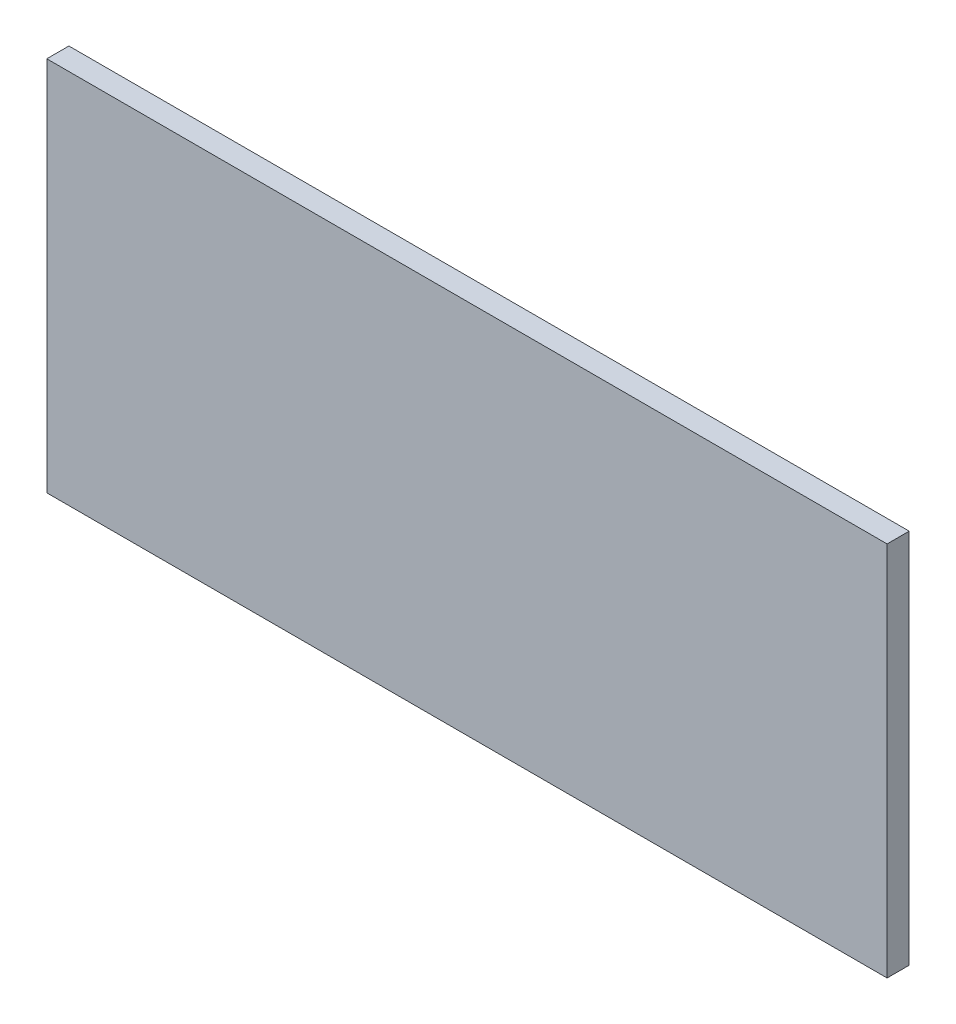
ISO-10303-21;
HEADER;
FILE_DESCRIPTION(('STEP AP214'),'2;1');
FILE_NAME('part.step','',(''),(''),'','','');
FILE_SCHEMA(('AUTOMOTIVE_DESIGN { 1 0 10303 214 1 1 1 1 }'));
ENDSEC;
DATA;
#1=APPLICATION_CONTEXT('core data for automotive mechanical design processes');
#2=APPLICATION_PROTOCOL_DEFINITION('international standard','automotive_design',2000,#1);
#3=PRODUCT_CONTEXT('',#1,'mechanical');
#4=PRODUCT('Part','Part','',(#3));
#5=PRODUCT_RELATED_PRODUCT_CATEGORY('part','',(#4));
#6=PRODUCT_DEFINITION_FORMATION('','',#4);
#7=PRODUCT_DEFINITION_CONTEXT('part definition',#1,'design');
#8=PRODUCT_DEFINITION('design','',#6,#7);
#9=PRODUCT_DEFINITION_SHAPE('','',#8);
#10=(LENGTH_UNIT() NAMED_UNIT(*) SI_UNIT(.MILLI.,.METRE.));
#11=(NAMED_UNIT(*) PLANE_ANGLE_UNIT() SI_UNIT($,.RADIAN.));
#12=(NAMED_UNIT(*) SI_UNIT($,.STERADIAN.) SOLID_ANGLE_UNIT());
#13=UNCERTAINTY_MEASURE_WITH_UNIT(LENGTH_MEASURE(1.E-05),#10,'distance_accuracy_value','');
#14=(GEOMETRIC_REPRESENTATION_CONTEXT(3) GLOBAL_UNCERTAINTY_ASSIGNED_CONTEXT((#13)) GLOBAL_UNIT_ASSIGNED_CONTEXT((#10,
#11,#12)) REPRESENTATION_CONTEXT('',''));
#15=CARTESIAN_POINT('',(0.,0.,0.));
#16=DIRECTION('',(0.,0.,1.));
#17=DIRECTION('',(1.,0.,0.));
#18=AXIS2_PLACEMENT_3D('',#15,#16,#17);
#19=CARTESIAN_POINT('',(-95.,-42.5,5.));
#20=DIRECTION('',(1.,0.,0.));
#21=DIRECTION('',(0.,0.,-1.));
#22=AXIS2_PLACEMENT_3D('',#19,#20,#21);
#23=PLANE('',#22);
#24=DIRECTION('',(0.,-1.,0.));
#25=VECTOR('',#24,1.);
#26=CARTESIAN_POINT('',(-95.,-42.5,0.));
#27=LINE('',#26,#25);
#28=CARTESIAN_POINT('',(-95.,42.5,0.));
#29=VERTEX_POINT('',#28);
#30=CARTESIAN_POINT('',(-95.,-42.5,0.));
#31=VERTEX_POINT('',#30);
#32=EDGE_CURVE('E115',#29,#31,#27,.T.);
#33=ORIENTED_EDGE('',*,*,#32,.T.);
#34=DIRECTION('',(0.,0.,-1.));
#35=VECTOR('',#34,1.);
#36=CARTESIAN_POINT('',(-95.,-42.5,5.));
#37=LINE('',#36,#35);
#38=CARTESIAN_POINT('',(-95.,-42.5,5.));
#39=VERTEX_POINT('',#38);
#40=EDGE_CURVE('E106',#39,#31,#37,.T.);
#41=ORIENTED_EDGE('',*,*,#40,.F.);
#42=DIRECTION('',(0.,-1.,0.));
#43=VECTOR('',#42,1.);
#44=CARTESIAN_POINT('',(-95.,-42.5,5.));
#45=LINE('',#44,#43);
#46=CARTESIAN_POINT('',(-95.,42.5,5.));
#47=VERTEX_POINT('',#46);
#48=EDGE_CURVE('E100',#47,#39,#45,.T.);
#49=ORIENTED_EDGE('',*,*,#48,.F.);
#50=DIRECTION('',(0.,0.,-1.));
#51=VECTOR('',#50,1.);
#52=CARTESIAN_POINT('',(-95.,42.5,5.));
#53=LINE('',#52,#51);
#54=EDGE_CURVE('E111',#47,#29,#53,.T.);
#55=ORIENTED_EDGE('',*,*,#54,.T.);
#56=EDGE_LOOP('',(#33,#41,#49,#55));
#57=FACE_BOUND('',#56,.T.);
#58=ADVANCED_FACE('F47',(#57),#23,.F.);
#59=CARTESIAN_POINT('',(95.,-42.5,5.));
#60=DIRECTION('',(0.,1.,0.));
#61=DIRECTION('',(-1.,0.,0.));
#62=AXIS2_PLACEMENT_3D('',#59,#60,#61);
#63=PLANE('',#62);
#64=DIRECTION('',(1.,0.,0.));
#65=VECTOR('',#64,1.);
#66=CARTESIAN_POINT('',(95.,-42.5,0.));
#67=LINE('',#66,#65);
#68=CARTESIAN_POINT('',(95.,-42.5,0.));
#69=VERTEX_POINT('',#68);
#70=EDGE_CURVE('E105',#31,#69,#67,.T.);
#71=ORIENTED_EDGE('',*,*,#70,.T.);
#72=DIRECTION('',(0.,0.,-1.));
#73=VECTOR('',#72,1.);
#74=CARTESIAN_POINT('',(95.,-42.5,5.));
#75=LINE('',#74,#73);
#76=CARTESIAN_POINT('',(95.,-42.5,5.));
#77=VERTEX_POINT('',#76);
#78=EDGE_CURVE('E103',#77,#69,#75,.T.);
#79=ORIENTED_EDGE('',*,*,#78,.F.);
#80=DIRECTION('',(1.,0.,0.));
#81=VECTOR('',#80,1.);
#82=CARTESIAN_POINT('',(95.,-42.5,5.));
#83=LINE('',#82,#81);
#84=EDGE_CURVE('E95',#39,#77,#83,.T.);
#85=ORIENTED_EDGE('',*,*,#84,.F.);
#86=ORIENTED_EDGE('',*,*,#40,.T.);
#87=EDGE_LOOP('',(#71,#79,#85,#86));
#88=FACE_BOUND('',#87,.T.);
#89=ADVANCED_FACE('F104',(#88),#63,.F.);
#90=CARTESIAN_POINT('',(95.,-42.5,5.));
#91=DIRECTION('',(-1.,0.,0.));
#92=DIRECTION('',(0.,0.,1.));
#93=AXIS2_PLACEMENT_3D('',#90,#91,#92);
#94=PLANE('',#93);
#95=DIRECTION('',(0.,1.,0.));
#96=VECTOR('',#95,1.);
#97=CARTESIAN_POINT('',(95.,-42.5,0.));
#98=LINE('',#97,#96);
#99=CARTESIAN_POINT('',(95.,42.5,0.));
#100=VERTEX_POINT('',#99);
#101=EDGE_CURVE('E81',#69,#100,#98,.T.);
#102=ORIENTED_EDGE('',*,*,#101,.T.);
#103=DIRECTION('',(0.,0.,-1.));
#104=VECTOR('',#103,1.);
#105=CARTESIAN_POINT('',(95.,42.5,5.));
#106=LINE('',#105,#104);
#107=CARTESIAN_POINT('',(95.,42.5,5.));
#108=VERTEX_POINT('',#107);
#109=EDGE_CURVE('E107',#108,#100,#106,.T.);
#110=ORIENTED_EDGE('',*,*,#109,.F.);
#111=DIRECTION('',(0.,1.,0.));
#112=VECTOR('',#111,1.);
#113=CARTESIAN_POINT('',(95.,-42.5,5.));
#114=LINE('',#113,#112);
#115=EDGE_CURVE('E98',#77,#108,#114,.T.);
#116=ORIENTED_EDGE('',*,*,#115,.F.);
#117=ORIENTED_EDGE('',*,*,#78,.T.);
#118=EDGE_LOOP('',(#102,#110,#116,#117));
#119=FACE_BOUND('',#118,.T.);
#120=ADVANCED_FACE('F109',(#119),#94,.F.);
#121=CARTESIAN_POINT('',(95.,42.5,5.));
#122=DIRECTION('',(0.,-1.,0.));
#123=DIRECTION('',(1.,0.,0.));
#124=AXIS2_PLACEMENT_3D('',#121,#122,#123);
#125=PLANE('',#124);
#126=DIRECTION('',(-1.,0.,0.));
#127=VECTOR('',#126,1.);
#128=CARTESIAN_POINT('',(95.,42.5,0.));
#129=LINE('',#128,#127);
#130=EDGE_CURVE('E87',#100,#29,#129,.T.);
#131=ORIENTED_EDGE('',*,*,#130,.T.);
#132=ORIENTED_EDGE('',*,*,#54,.F.);
#133=DIRECTION('',(-1.,0.,0.));
#134=VECTOR('',#133,1.);
#135=CARTESIAN_POINT('',(95.,42.5,5.));
#136=LINE('',#135,#134);
#137=EDGE_CURVE('E64',#108,#47,#136,.T.);
#138=ORIENTED_EDGE('',*,*,#137,.F.);
#139=ORIENTED_EDGE('',*,*,#109,.T.);
#140=EDGE_LOOP('',(#131,#132,#138,#139));
#141=FACE_BOUND('',#140,.T.);
#142=ADVANCED_FACE('F200',(#141),#125,.F.);
#143=CARTESIAN_POINT('',(0.,0.,5.));
#144=DIRECTION('',(0.,0.,1.));
#145=DIRECTION('',(1.,0.,0.));
#146=AXIS2_PLACEMENT_3D('',#143,#144,#145);
#147=PLANE('',#146);
#148=ORIENTED_EDGE('',*,*,#48,.T.);
#149=ORIENTED_EDGE('',*,*,#84,.T.);
#150=ORIENTED_EDGE('',*,*,#115,.T.);
#151=ORIENTED_EDGE('',*,*,#137,.T.);
#152=EDGE_LOOP('',(#148,#149,#150,#151));
#153=FACE_BOUND('',#152,.T.);
#154=ADVANCED_FACE('F96',(#153),#147,.T.);
#155=CARTESIAN_POINT('',(0.,0.,0.));
#156=DIRECTION('',(0.,0.,1.));
#157=DIRECTION('',(1.,0.,0.));
#158=AXIS2_PLACEMENT_3D('',#155,#156,#157);
#159=PLANE('',#158);
#160=CARTESIAN_POINT('',(-50.5,-15.5,0.));
#161=DIRECTION('',(0.,0.,1.));
#162=DIRECTION('',(1.,0.,0.));
#163=AXIS2_PLACEMENT_3D('',#160,#161,#162);
#164=CIRCLE('',#163,3.);
#165=CARTESIAN_POINT('',(-47.5,-15.5,0.));
#166=VERTEX_POINT('',#165);
#167=EDGE_CURVE('E50',#166,#166,#164,.T.);
#168=ORIENTED_EDGE('',*,*,#167,.T.);
#169=EDGE_LOOP('',(#168));
#170=FACE_BOUND('',#169,.T.);
#171=CARTESIAN_POINT('',(32.,-15.5,0.));
#172=DIRECTION('',(0.,0.,1.));
#173=DIRECTION('',(1.,0.,0.));
#174=AXIS2_PLACEMENT_3D('',#171,#172,#173);
#175=CIRCLE('',#174,3.);
#176=CARTESIAN_POINT('',(35.,-15.5,0.));
#177=VERTEX_POINT('',#176);
#178=EDGE_CURVE('E141',#177,#177,#175,.T.);
#179=ORIENTED_EDGE('',*,*,#178,.T.);
#180=EDGE_LOOP('',(#179));
#181=FACE_BOUND('',#180,.T.);
#182=CARTESIAN_POINT('',(30.,32.5,0.));
#183=DIRECTION('',(0.,0.,1.));
#184=DIRECTION('',(1.,0.,0.));
#185=AXIS2_PLACEMENT_3D('',#182,#183,#184);
#186=CIRCLE('',#185,2.5);
#187=CARTESIAN_POINT('',(32.5,32.5,0.));
#188=VERTEX_POINT('',#187);
#189=EDGE_CURVE('E134',#188,#188,#186,.T.);
#190=ORIENTED_EDGE('',*,*,#189,.T.);
#191=EDGE_LOOP('',(#190));
#192=FACE_BOUND('',#191,.T.);
#193=CARTESIAN_POINT('',(-45.,32.5,0.));
#194=DIRECTION('',(0.,0.,1.));
#195=DIRECTION('',(1.,0.,0.));
#196=AXIS2_PLACEMENT_3D('',#193,#194,#195);
#197=CIRCLE('',#196,2.5);
#198=CARTESIAN_POINT('',(-42.5,32.5,0.));
#199=VERTEX_POINT('',#198);
#200=EDGE_CURVE('E118',#199,#199,#197,.T.);
#201=ORIENTED_EDGE('',*,*,#200,.T.);
#202=EDGE_LOOP('',(#201));
#203=FACE_BOUND('',#202,.T.);
#204=ORIENTED_EDGE('',*,*,#32,.F.);
#205=ORIENTED_EDGE('',*,*,#130,.F.);
#206=ORIENTED_EDGE('',*,*,#101,.F.);
#207=ORIENTED_EDGE('',*,*,#70,.F.);
#208=EDGE_LOOP('',(#204,#205,#206,#207));
#209=FACE_BOUND('',#208,.T.);
#210=ADVANCED_FACE('F181',(#170,#181,#192,#203,#209),#159,.F.);
#211=CARTESIAN_POINT('',(-45.,32.5,-5.));
#212=DIRECTION('',(0.,0.,1.));
#213=DIRECTION('',(1.,0.,0.));
#214=AXIS2_PLACEMENT_3D('',#211,#212,#213);
#215=CYLINDRICAL_SURFACE('',#214,2.5);
#216=CARTESIAN_POINT('',(-45.,32.5,-5.));
#217=DIRECTION('',(0.,0.,1.));
#218=DIRECTION('',(1.,0.,0.));
#219=AXIS2_PLACEMENT_3D('',#216,#217,#218);
#220=CIRCLE('',#219,2.5);
#221=CARTESIAN_POINT('',(-42.5,32.5,-5.));
#222=VERTEX_POINT('',#221);
#223=EDGE_CURVE('E131',#222,#222,#220,.T.);
#224=ORIENTED_EDGE('',*,*,#223,.T.);
#225=EDGE_LOOP('',(#224));
#226=FACE_BOUND('',#225,.T.);
#227=ORIENTED_EDGE('',*,*,#200,.F.);
#228=EDGE_LOOP('',(#227));
#229=FACE_BOUND('',#228,.T.);
#230=ADVANCED_FACE('F165',(#226,#229),#215,.T.);
#231=CARTESIAN_POINT('',(-45.,32.5,-5.));
#232=DIRECTION('',(0.,0.,1.));
#233=DIRECTION('',(1.,0.,0.));
#234=AXIS2_PLACEMENT_3D('',#231,#232,#233);
#235=CYLINDRICAL_SURFACE('',#234,1.5);
#236=CARTESIAN_POINT('',(-45.,32.5,-5.));
#237=DIRECTION('',(0.,0.,1.));
#238=DIRECTION('',(1.,0.,0.));
#239=AXIS2_PLACEMENT_3D('',#236,#237,#238);
#240=CIRCLE('',#239,1.5);
#241=CARTESIAN_POINT('',(-43.5,32.5,-5.));
#242=VERTEX_POINT('',#241);
#243=EDGE_CURVE('E137',#242,#242,#240,.T.);
#244=ORIENTED_EDGE('',*,*,#243,.F.);
#245=EDGE_LOOP('',(#244));
#246=FACE_BOUND('',#245,.T.);
#247=CARTESIAN_POINT('',(-45.,32.5,0.));
#248=DIRECTION('',(0.,0.,1.));
#249=DIRECTION('',(1.,0.,0.));
#250=AXIS2_PLACEMENT_3D('',#247,#248,#249);
#251=CIRCLE('',#250,1.5);
#252=CARTESIAN_POINT('',(-43.5,32.5,0.));
#253=VERTEX_POINT('',#252);
#254=EDGE_CURVE('E125',#253,#253,#251,.T.);
#255=ORIENTED_EDGE('',*,*,#254,.T.);
#256=EDGE_LOOP('',(#255));
#257=FACE_BOUND('',#256,.T.);
#258=ADVANCED_FACE('F171',(#246,#257),#235,.F.);
#259=CARTESIAN_POINT('',(-45.,32.5,-5.));
#260=DIRECTION('',(0.,0.,1.));
#261=DIRECTION('',(1.,0.,0.));
#262=AXIS2_PLACEMENT_3D('',#259,#260,#261);
#263=PLANE('',#262);
#264=ORIENTED_EDGE('',*,*,#243,.T.);
#265=EDGE_LOOP('',(#264));
#266=FACE_BOUND('',#265,.T.);
#267=ORIENTED_EDGE('',*,*,#223,.F.);
#268=EDGE_LOOP('',(#267));
#269=FACE_BOUND('',#268,.T.);
#270=ADVANCED_FACE('F168',(#266,#269),#263,.F.);
#271=ORIENTED_EDGE('',*,*,#254,.F.);
#272=EDGE_LOOP('',(#271));
#273=FACE_BOUND('',#272,.T.);
#274=ADVANCED_FACE('F170',(#273),#159,.F.);
#275=CARTESIAN_POINT('',(30.,32.5,-5.));
#276=DIRECTION('',(0.,0.,1.));
#277=DIRECTION('',(1.,0.,0.));
#278=AXIS2_PLACEMENT_3D('',#275,#276,#277);
#279=CYLINDRICAL_SURFACE('',#278,2.5);
#280=CARTESIAN_POINT('',(30.,32.5,-5.));
#281=DIRECTION('',(0.,0.,1.));
#282=DIRECTION('',(1.,0.,0.));
#283=AXIS2_PLACEMENT_3D('',#280,#281,#282);
#284=CIRCLE('',#283,2.5);
#285=CARTESIAN_POINT('',(32.5,32.5,-5.));
#286=VERTEX_POINT('',#285);
#287=EDGE_CURVE('E143',#286,#286,#284,.T.);
#288=ORIENTED_EDGE('',*,*,#287,.T.);
#289=EDGE_LOOP('',(#288));
#290=FACE_BOUND('',#289,.T.);
#291=ORIENTED_EDGE('',*,*,#189,.F.);
#292=EDGE_LOOP('',(#291));
#293=FACE_BOUND('',#292,.T.);
#294=ADVANCED_FACE('F178',(#290,#293),#279,.T.);
#295=CARTESIAN_POINT('',(30.,32.5,-5.));
#296=DIRECTION('',(0.,0.,1.));
#297=DIRECTION('',(1.,0.,0.));
#298=AXIS2_PLACEMENT_3D('',#295,#296,#297);
#299=CYLINDRICAL_SURFACE('',#298,1.5);
#300=CARTESIAN_POINT('',(30.,32.5,-5.));
#301=DIRECTION('',(0.,0.,1.));
#302=DIRECTION('',(1.,0.,0.));
#303=AXIS2_PLACEMENT_3D('',#300,#301,#302);
#304=CIRCLE('',#303,1.5);
#305=CARTESIAN_POINT('',(31.5,32.5,-5.));
#306=VERTEX_POINT('',#305);
#307=EDGE_CURVE('E138',#306,#306,#304,.T.);
#308=ORIENTED_EDGE('',*,*,#307,.F.);
#309=EDGE_LOOP('',(#308));
#310=FACE_BOUND('',#309,.T.);
#311=CARTESIAN_POINT('',(30.,32.5,0.));
#312=DIRECTION('',(0.,0.,1.));
#313=DIRECTION('',(1.,0.,0.));
#314=AXIS2_PLACEMENT_3D('',#311,#312,#313);
#315=CIRCLE('',#314,1.5);
#316=CARTESIAN_POINT('',(31.5,32.5,0.));
#317=VERTEX_POINT('',#316);
#318=EDGE_CURVE('E128',#317,#317,#315,.T.);
#319=ORIENTED_EDGE('',*,*,#318,.T.);
#320=EDGE_LOOP('',(#319));
#321=FACE_BOUND('',#320,.T.);
#322=ADVANCED_FACE('F238',(#310,#321),#299,.F.);
#323=CARTESIAN_POINT('',(30.,32.5,-5.));
#324=DIRECTION('',(0.,0.,1.));
#325=DIRECTION('',(1.,0.,0.));
#326=AXIS2_PLACEMENT_3D('',#323,#324,#325);
#327=PLANE('',#326);
#328=ORIENTED_EDGE('',*,*,#307,.T.);
#329=EDGE_LOOP('',(#328));
#330=FACE_BOUND('',#329,.T.);
#331=ORIENTED_EDGE('',*,*,#287,.F.);
#332=EDGE_LOOP('',(#331));
#333=FACE_BOUND('',#332,.T.);
#334=ADVANCED_FACE('F230',(#330,#333),#327,.F.);
#335=ORIENTED_EDGE('',*,*,#318,.F.);
#336=EDGE_LOOP('',(#335));
#337=FACE_BOUND('',#336,.T.);
#338=ADVANCED_FACE('F182',(#337),#159,.F.);
#339=CARTESIAN_POINT('',(32.,-15.5,-5.));
#340=DIRECTION('',(0.,0.,1.));
#341=DIRECTION('',(1.,0.,0.));
#342=AXIS2_PLACEMENT_3D('',#339,#340,#341);
#343=CYLINDRICAL_SURFACE('',#342,3.);
#344=CARTESIAN_POINT('',(32.,-15.5,-5.));
#345=DIRECTION('',(0.,0.,1.));
#346=DIRECTION('',(1.,0.,0.));
#347=AXIS2_PLACEMENT_3D('',#344,#345,#346);
#348=CIRCLE('',#347,3.);
#349=CARTESIAN_POINT('',(35.,-15.5,-5.));
#350=VERTEX_POINT('',#349);
#351=EDGE_CURVE('E150',#350,#350,#348,.T.);
#352=ORIENTED_EDGE('',*,*,#351,.T.);
#353=EDGE_LOOP('',(#352));
#354=FACE_BOUND('',#353,.T.);
#355=ORIENTED_EDGE('',*,*,#178,.F.);
#356=EDGE_LOOP('',(#355));
#357=FACE_BOUND('',#356,.T.);
#358=ADVANCED_FACE('F229',(#354,#357),#343,.T.);
#359=CARTESIAN_POINT('',(32.,-15.5,-5.));
#360=DIRECTION('',(0.,0.,1.));
#361=DIRECTION('',(1.,0.,0.));
#362=AXIS2_PLACEMENT_3D('',#359,#360,#361);
#363=CYLINDRICAL_SURFACE('',#362,1.5);
#364=CARTESIAN_POINT('',(32.,-15.5,-5.));
#365=DIRECTION('',(0.,0.,1.));
#366=DIRECTION('',(1.,0.,0.));
#367=AXIS2_PLACEMENT_3D('',#364,#365,#366);
#368=CIRCLE('',#367,1.5);
#369=CARTESIAN_POINT('',(33.5,-15.5,-5.));
#370=VERTEX_POINT('',#369);
#371=EDGE_CURVE('E144',#370,#370,#368,.T.);
#372=ORIENTED_EDGE('',*,*,#371,.F.);
#373=EDGE_LOOP('',(#372));
#374=FACE_BOUND('',#373,.T.);
#375=CARTESIAN_POINT('',(32.,-15.5,0.));
#376=DIRECTION('',(0.,0.,1.));
#377=DIRECTION('',(1.,0.,0.));
#378=AXIS2_PLACEMENT_3D('',#375,#376,#377);
#379=CIRCLE('',#378,1.5);
#380=CARTESIAN_POINT('',(33.5,-15.5,0.));
#381=VERTEX_POINT('',#380);
#382=EDGE_CURVE('E56',#381,#381,#379,.T.);
#383=ORIENTED_EDGE('',*,*,#382,.T.);
#384=EDGE_LOOP('',(#383));
#385=FACE_BOUND('',#384,.T.);
#386=ADVANCED_FACE('F225',(#374,#385),#363,.F.);
#387=CARTESIAN_POINT('',(32.,-15.5,-5.));
#388=DIRECTION('',(0.,0.,1.));
#389=DIRECTION('',(1.,0.,0.));
#390=AXIS2_PLACEMENT_3D('',#387,#388,#389);
#391=PLANE('',#390);
#392=ORIENTED_EDGE('',*,*,#371,.T.);
#393=EDGE_LOOP('',(#392));
#394=FACE_BOUND('',#393,.T.);
#395=ORIENTED_EDGE('',*,*,#351,.F.);
#396=EDGE_LOOP('',(#395));
#397=FACE_BOUND('',#396,.T.);
#398=ADVANCED_FACE('F217',(#394,#397),#391,.F.);
#399=ORIENTED_EDGE('',*,*,#382,.F.);
#400=EDGE_LOOP('',(#399));
#401=FACE_BOUND('',#400,.T.);
#402=ADVANCED_FACE('F207',(#401),#159,.F.);
#403=CARTESIAN_POINT('',(-50.5,-15.5,-5.));
#404=DIRECTION('',(0.,0.,1.));
#405=DIRECTION('',(1.,0.,0.));
#406=AXIS2_PLACEMENT_3D('',#403,#404,#405);
#407=CYLINDRICAL_SURFACE('',#406,3.);
#408=CARTESIAN_POINT('',(-50.5,-15.5,-5.));
#409=DIRECTION('',(0.,0.,1.));
#410=DIRECTION('',(1.,0.,0.));
#411=AXIS2_PLACEMENT_3D('',#408,#409,#410);
#412=CIRCLE('',#411,3.);
#413=CARTESIAN_POINT('',(-47.5,-15.5,-5.));
#414=VERTEX_POINT('',#413);
#415=EDGE_CURVE('E264',#414,#414,#412,.T.);
#416=ORIENTED_EDGE('',*,*,#415,.T.);
#417=EDGE_LOOP('',(#416));
#418=FACE_BOUND('',#417,.T.);
#419=ORIENTED_EDGE('',*,*,#167,.F.);
#420=EDGE_LOOP('',(#419));
#421=FACE_BOUND('',#420,.T.);
#422=ADVANCED_FACE('F216',(#418,#421),#407,.T.);
#423=CARTESIAN_POINT('',(-50.5,-15.5,-5.));
#424=DIRECTION('',(0.,0.,1.));
#425=DIRECTION('',(1.,0.,0.));
#426=AXIS2_PLACEMENT_3D('',#423,#424,#425);
#427=CYLINDRICAL_SURFACE('',#426,1.5);
#428=CARTESIAN_POINT('',(-50.5,-15.5,-5.));
#429=DIRECTION('',(0.,0.,1.));
#430=DIRECTION('',(1.,0.,0.));
#431=AXIS2_PLACEMENT_3D('',#428,#429,#430);
#432=CIRCLE('',#431,1.5);
#433=CARTESIAN_POINT('',(-49.,-15.5,-5.));
#434=VERTEX_POINT('',#433);
#435=EDGE_CURVE('E263',#434,#434,#432,.T.);
#436=ORIENTED_EDGE('',*,*,#435,.F.);
#437=EDGE_LOOP('',(#436));
#438=FACE_BOUND('',#437,.T.);
#439=CARTESIAN_POINT('',(-50.5,-15.5,0.));
#440=DIRECTION('',(0.,0.,1.));
#441=DIRECTION('',(1.,0.,0.));
#442=AXIS2_PLACEMENT_3D('',#439,#440,#441);
#443=CIRCLE('',#442,1.5);
#444=CARTESIAN_POINT('',(-49.,-15.5,0.));
#445=VERTEX_POINT('',#444);
#446=EDGE_CURVE('E11',#445,#445,#443,.T.);
#447=ORIENTED_EDGE('',*,*,#446,.T.);
#448=EDGE_LOOP('',(#447));
#449=FACE_BOUND('',#448,.T.);
#450=ADVANCED_FACE('F211',(#438,#449),#427,.F.);
#451=CARTESIAN_POINT('',(-50.5,-15.5,-5.));
#452=DIRECTION('',(0.,0.,1.));
#453=DIRECTION('',(1.,0.,0.));
#454=AXIS2_PLACEMENT_3D('',#451,#452,#453);
#455=PLANE('',#454);
#456=ORIENTED_EDGE('',*,*,#435,.T.);
#457=EDGE_LOOP('',(#456));
#458=FACE_BOUND('',#457,.T.);
#459=ORIENTED_EDGE('',*,*,#415,.F.);
#460=EDGE_LOOP('',(#459));
#461=FACE_BOUND('',#460,.T.);
#462=ADVANCED_FACE('F205',(#458,#461),#455,.F.);
#463=ORIENTED_EDGE('',*,*,#446,.F.);
#464=EDGE_LOOP('',(#463));
#465=FACE_BOUND('',#464,.T.);
#466=ADVANCED_FACE('F195',(#465),#159,.F.);
#467=CLOSED_SHELL('',(#58,#89,#120,#142,#154,#210,#230,#258,#270,#274,#294,#322,#334,#338,#358,
#386,#398,#402,#422,#450,#462,#466));
#468=MANIFOLD_SOLID_BREP('B2',#467);
#469=ADVANCED_BREP_SHAPE_REPRESENTATION('',(#18,#468),#14);
#470=SHAPE_DEFINITION_REPRESENTATION(#9,#469);
ENDSEC;
END-ISO-10303-21;
